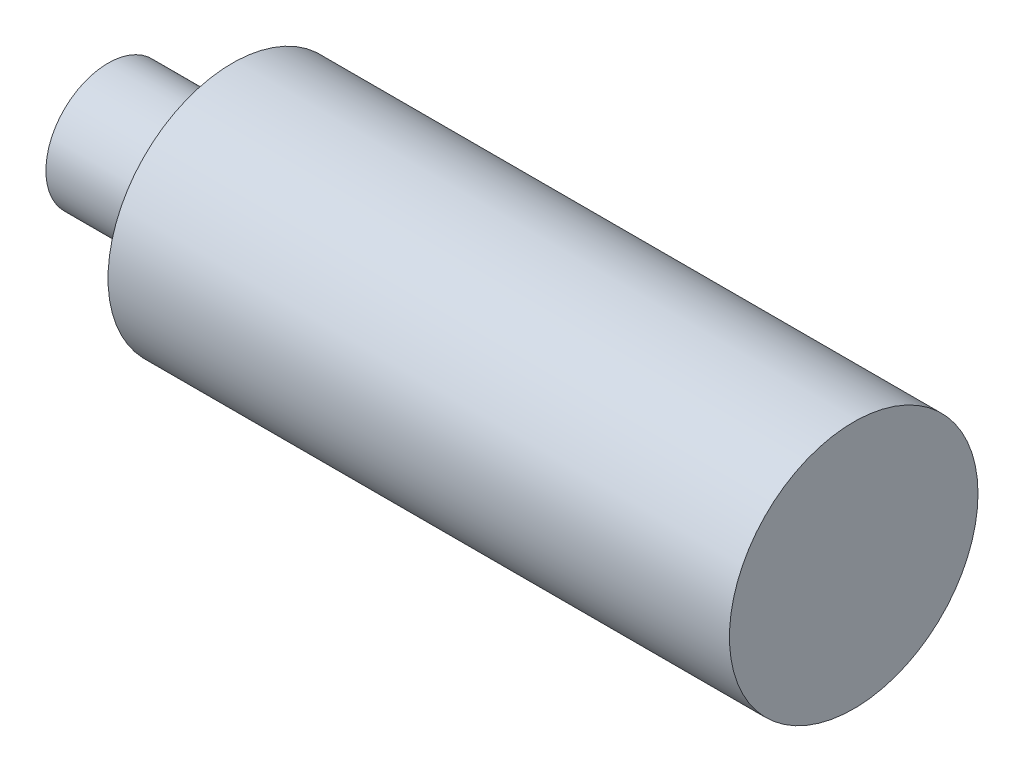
from build123d import *

# Parameters (mm, degrees)
SKETCH_1_R      = 1
EXTRUDE_1_DEPTH = 2
SKETCH_2_R      = 2
EXTRUDE_2_DEPTH = 10


with BuildPart() as part:
    # Sketch 1 → Extrude 1 (new body)
    with BuildSketch(Plane(origin=(0, 0, 0), x_dir=(0, 0, -1), z_dir=(1, 0, 0))):
        Circle(SKETCH_1_R)
    extrude(amount=EXTRUDE_1_DEPTH)

    # Sketch 2 → Extrude 2 (add)
    with BuildSketch(Plane(origin=(2, 0, 0), x_dir=(0, 0, -1), z_dir=(1, 0, 0))):
        Circle(SKETCH_2_R)
    extrude(amount=EXTRUDE_2_DEPTH)


solid = part.part
